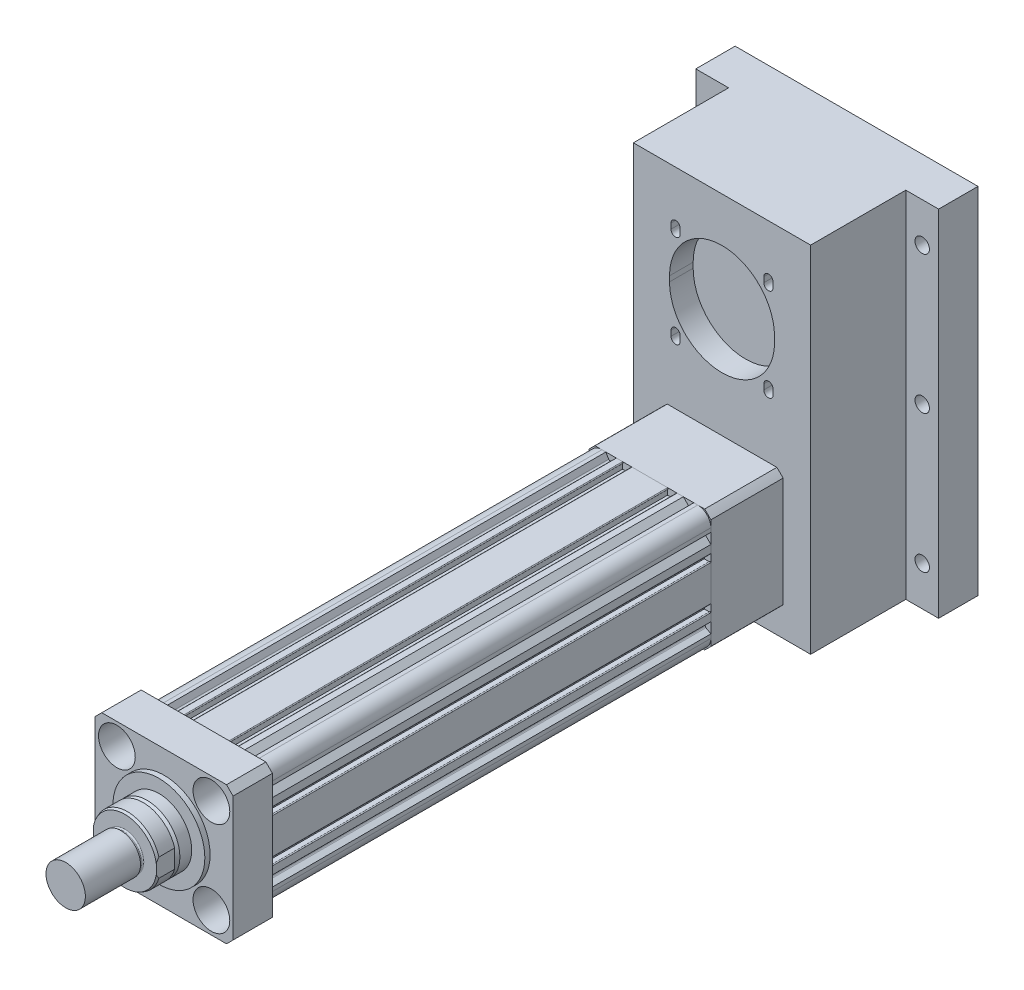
from build123d import *
from OCP.BRepFilletAPI import BRepFilletAPI_MakeChamfer

# Parameters (mm, degrees)
SKETCH_1_R          = 40
SKETCH_1_R_2        = 4.35
EXTRUDE_1_DEPTH     = 340
EXTRUDE_1_2_DEPTH   = 30
SKETCH_3_R          = 35
EXTRUDE_2_DEPTH     = 4
SKETCH_3_3_R        = 6.5
CUT_EXTRUDE_1_DEPTH = 30
SKETCH_3_4_R        = 6.5
CUT_EXTRUDE_2_DEPTH = 17
SKETCH_4_R          = 25
EXTRUDE_3_DEPTH     = 12
CHAMFER_1_SIZE      = 3
CHAMFER_1_SIZE2     = 1.732050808
EXTRUDE_4_DEPTH     = 14
CHAMFER_2_SIZE      = 2
CHAMFER_2_SIZE2     = 0.727940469
SKETCH_6_R          = 13.5
EXTRUDE_5_DEPTH     = 3
SKETCH_7_R          = 15
EXTRUDE_6_DEPTH     = 42
FILLET_1_R          = 1
EXTRUDE_7_DEPTH     = 55
SKETCH_12_W         = 135
SKETCH_12_H         = 270
EXTRUDE_9_DEPTH     = 72.5
CUT_EXTRUDE_5_DEPTH = 18
CUT_EXTRUDE_6_DEPTH = 18
CUT_EXTRUDE_START   = -11.5
CUT_EXTRUDE_7_DEPTH = 6.5
SKETCH_16_W         = 185
SKETCH_16_H         = 270
SKETCH_16_R         = 5.5
EXTRUDE_10_DEPTH    = 30
SKETCH_17_W         = 105
SKETCH_17_H         = 105
EXTRUDE_11_DEPTH    = 30
SKETCH_18_R         = 14
CUT_EXTRUDE_8_DEPTH = 28
SKETCH_19_R         = 6.5
CUT_EXTRUDE_9_DEPTH = 30
CHAMFER_3_SIZE      = 5


with BuildPart() as part:
    # Sketch 1 → Extrude 1 (new body)
    with BuildSketch(Plane.XY):
        with BuildLine():
            Line((46.5, -36.5), (46.5, -33.5))
            Line((46.5, -33.5), (42.782554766, -31.353731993))
            ThreePointArc((42.782554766, -31.353731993), (42.192820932, -30.47113294), (42.534026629, -29.465973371))
            Line((42.534026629, -29.465973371), (46.5, -25.5))
            Line((46.5, -25.5), (46.5, -19.6))
            ThreePointArc((46.5, -19.6), (46.353553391, -19.246446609), (46, -19.1))
            ThreePointArc((46, -19.1), (45.646446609, -19.246446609), (45.5, -19.6))
            Line((45.5, -19.6), (41.5, -19.6))
            Line((41.5, -19.6), (41.5, -13.5))
            Line((41.5, -13.5), (45.5, -13.5))
            ThreePointArc((45.5, -13.5), (45.646446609, -13.853553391), (46, -14))
            ThreePointArc((46, -14), (46.353553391, -13.853553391), (46.5, -13.5))
            Line((46.5, -13.5), (46.5, 13.5))
            ThreePointArc((46.5, 13.5), (46.353553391, 13.853553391), (46, 14))
            ThreePointArc((46, 14), (45.646446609, 13.853553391), (45.5, 13.5))
            Line((45.5, 13.5), (41.5, 13.5))
            Line((41.5, 13.5), (41.5, 19.6))
            Line((41.5, 19.6), (45.5, 19.6))
            ThreePointArc((45.5, 19.6), (45.646446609, 19.246446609), (46, 19.1))
            ThreePointArc((46, 19.1), (46.353553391, 19.246446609), (46.5, 19.6))
            Line((46.5, 19.6), (46.5, 25.5))
            Line((46.5, 25.5), (42.534026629, 29.465973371))
            ThreePointArc((42.534026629, 29.465973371), (42.192820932, 30.47113294), (42.782554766, 31.353731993))
            Line((42.782554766, 31.353731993), (46.5, 33.5))
            Line((46.5, 33.5), (46.5, 36.5))
            ThreePointArc((46.5, 36.5), (43.571067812, 43.571067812), (36.5, 46.5))
            Line((36.5, 46.5), (33.5, 46.5))
            Line((33.5, 46.5), (31.353731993, 42.782554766))
            ThreePointArc((31.353731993, 42.782554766), (30.47113294, 42.192820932), (29.465973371, 42.534026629))
            Line((29.465973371, 42.534026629), (25.5, 46.5))
            Line((25.5, 46.5), (20.8, 46.5))
            ThreePointArc((20.8, 46.5), (20.446446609, 46.353553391), (20.3, 46))
            ThreePointArc((20.3, 46), (20.446446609, 45.646446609), (20.8, 45.5))
            Line((20.8, 45.5), (20.8, 41.5))
            Line((20.8, 41.5), (13.5, 41.5))
            Line((13.5, 41.5), (13.5, 45.5))
            ThreePointArc((13.5, 45.5), (13.853553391, 45.646446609), (14, 46))
            ThreePointArc((14, 46), (13.853553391, 46.353553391), (13.5, 46.5))
            Line((13.5, 46.5), (-13.5, 46.5))
            ThreePointArc((-13.5, 46.5), (-13.853553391, 46.353553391), (-14, 46))
            ThreePointArc((-14, 46), (-13.853553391, 45.646446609), (-13.5, 45.5))
            Line((-13.5, 45.5), (-13.5, 41.5))
            Line((-13.5, 41.5), (-20.8, 41.5))
            Line((-20.8, 41.5), (-20.8, 45.5))
            ThreePointArc((-20.8, 45.5), (-20.446446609, 45.646446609), (-20.3, 46))
            ThreePointArc((-20.3, 46), (-20.446446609, 46.353553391), (-20.8, 46.5))
            Line((-20.8, 46.5), (-25.5, 46.5))
            Line((-25.5, 46.5), (-29.465973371, 42.534026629))
            ThreePointArc((-29.465973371, 42.534026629), (-30.47113294, 42.192820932), (-31.353731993, 42.782554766))
            Line((-31.353731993, 42.782554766), (-33.5, 46.5))
            Line((-33.5, 46.5), (-36.5, 46.5))
            ThreePointArc((-36.5, 46.5), (-43.571067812, 43.571067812), (-46.5, 36.5))
            Line((-46.5, 36.5), (-46.5, 33.5))
            Line((-46.5, 33.5), (-42.782554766, 31.353731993))
            ThreePointArc((-42.782554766, 31.353731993), (-42.192820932, 30.47113294), (-42.534026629, 29.465973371))
            Line((-42.534026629, 29.465973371), (-46.5, 25.5))
            Line((-46.5, 25.5), (-46.5, 20))
            ThreePointArc((-46.5, 20), (-46.353553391, 19.646446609), (-46, 19.5))
            ThreePointArc((-46, 19.5), (-45.646446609, 19.646446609), (-45.5, 20))
            Line((-45.5, 20), (-41.5, 20))
            Line((-41.5, 20), (-41.5, 13.9))
            Line((-41.5, 13.9), (-45.5, 13.9))
            ThreePointArc((-45.5, 13.9), (-45.646446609, 14.253553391), (-46, 14.4))
            ThreePointArc((-46, 14.4), (-46.353553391, 14.253553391), (-46.5, 13.9))
            Line((-46.5, 13.9), (-46.5, -13.9))
            ThreePointArc((-46.5, -13.9), (-46.353553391, -14.253553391), (-46, -14.4))
            ThreePointArc((-46, -14.4), (-45.646446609, -14.253553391), (-45.5, -13.9))
            Line((-45.5, -13.9), (-41.5, -13.9))
            Line((-41.5, -13.9), (-41.5, -20))
            Line((-41.5, -20), (-45.5, -20))
            ThreePointArc((-45.5, -20), (-45.646446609, -19.646446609), (-46, -19.5))
            ThreePointArc((-46, -19.5), (-46.353553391, -19.646446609), (-46.5, -20))
            Line((-46.5, -20), (-46.5, -25.5))
            Line((-46.5, -25.5), (-42.534026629, -29.465973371))
            ThreePointArc((-42.534026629, -29.465973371), (-42.192820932, -30.47113294), (-42.782554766, -31.353731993))
            Line((-42.782554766, -31.353731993), (-46.5, -33.5))
            Line((-46.5, -33.5), (-46.5, -36.5))
            ThreePointArc((-46.5, -36.5), (-43.571067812, -43.571067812), (-36.5, -46.5))
            Line((-36.5, -46.5), (-33.5, -46.5))
            Line((-33.5, -46.5), (-31.353731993, -42.782554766))
            ThreePointArc((-31.353731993, -42.782554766), (-30.47113294, -42.192820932), (-29.465973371, -42.534026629))
            Line((-29.465973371, -42.534026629), (-25.5, -46.5))
            Line((-25.5, -46.5), (25.5, -46.5))
            Line((25.5, -46.5), (29.465973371, -42.534026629))
            ThreePointArc((29.465973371, -42.534026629), (30.47113294, -42.192820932), (31.353731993, -42.782554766))
            Line((31.353731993, -42.782554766), (33.5, -46.5))
            Line((33.5, -46.5), (36.5, -46.5))
            ThreePointArc((36.5, -46.5), (43.571067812, -43.571067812), (46.5, -36.5))
        make_face()
        Circle(SKETCH_1_R, mode=Mode.SUBTRACT)
        with Locations((36, -36)):
            Circle(SKETCH_1_R_2, mode=Mode.SUBTRACT)
        with Locations((-36, -36)):
            Circle(SKETCH_1_R_2, mode=Mode.SUBTRACT)
        with Locations((36, 36)):
            Circle(SKETCH_1_R_2, mode=Mode.SUBTRACT)
        with Locations((-36, 36)):
            Circle(SKETCH_1_R_2, mode=Mode.SUBTRACT)
        with BuildLine():
            Line((25.75, -42.5), (11.324751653, -42.5))
            ThreePointArc((11.324751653, -42.5), (10.829080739, -42.065653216), (11.194582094, -41.517241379))
            ThreePointArc((11.194582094, -41.517241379), (18.919894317, -38.613956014), (25.948275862, -34.288292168))
            ThreePointArc((25.948275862, -34.288292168), (26.472640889, -34.239297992), (26.75, -34.68699324))
            Line((26.75, -34.68699324), (26.75, -41.5))
            Line((26.75, -41.5), (25.75, -42.5))
        make_face(mode=Mode.SUBTRACT)
        with BuildLine():
            Line((-25.75, -42.5), (-11.324751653, -42.5))
            ThreePointArc((-11.324751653, -42.5), (-10.829080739, -42.065653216), (-11.194582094, -41.517241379))
            ThreePointArc((-11.194582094, -41.517241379), (-18.919894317, -38.613956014), (-25.948275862, -34.288292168))
            ThreePointArc((-25.948275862, -34.288292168), (-26.472640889, -34.239297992), (-26.75, -34.68699324))
            Line((-26.75, -34.68699324), (-26.75, -41.5))
            Line((-26.75, -41.5), (-25.75, -42.5))
        make_face(mode=Mode.SUBTRACT)
        with BuildLine():
            Line((26.312283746, 40), (20.798294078, 40))
            ThreePointArc((20.798294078, 40), (20.548294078, 39.933012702), (20.365281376, 39.75))
            Line((20.365281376, 39.75), (19.794336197, 38.761093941))
            ThreePointArc((19.794336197, 38.761093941), (19.747068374, 38.372059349), (19.994850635, 38.068437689))
            ThreePointArc((19.994850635, 38.068437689), (22.57372353, 36.598183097), (25.045011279, 34.953503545))
            ThreePointArc((25.045011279, 34.953503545), (25.441798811, 34.871210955), (25.769245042, 35.109939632))
            Line((25.769245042, 35.109939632), (27.64187192, 38.353424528))
            ThreePointArc((27.64187192, 38.353424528), (27.704581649, 38.668687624), (27.562412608, 38.956977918))
            Line((27.562412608, 38.956977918), (26.665837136, 39.853553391))
            ThreePointArc((26.665837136, 39.853553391), (26.503625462, 39.961939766), (26.312283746, 40))
        make_face(mode=Mode.SUBTRACT)
        with BuildLine():
            Line((38.956977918, 27.562412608), (39.853553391, 26.665837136))
            ThreePointArc((39.853553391, 26.665837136), (39.961939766, 26.503625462), (40, 26.312283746))
            Line((40, 26.312283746), (40, 20.798294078))
            ThreePointArc((40, 20.798294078), (39.933012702, 20.548294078), (39.75, 20.365281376))
            Line((39.75, 20.365281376), (38.761093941, 19.794336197))
            ThreePointArc((38.761093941, 19.794336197), (38.372059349, 19.747068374), (38.068437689, 19.994850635))
            ThreePointArc((38.068437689, 19.994850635), (36.598183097, 22.57372353), (34.953503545, 25.045011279))
            ThreePointArc((34.953503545, 25.045011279), (34.871210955, 25.441798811), (35.109939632, 25.769245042))
            Line((35.109939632, 25.769245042), (38.353424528, 27.64187192))
            ThreePointArc((38.353424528, 27.64187192), (38.668687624, 27.704581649), (38.956977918, 27.562412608))
        make_face(mode=Mode.SUBTRACT)
        with BuildLine():
            Line((38.956977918, -27.562412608), (39.853553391, -26.665837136))
            ThreePointArc((39.853553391, -26.665837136), (39.961939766, -26.503625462), (40, -26.312283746))
            Line((40, -26.312283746), (40, -20.798294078))
            ThreePointArc((40, -20.798294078), (39.933012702, -20.548294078), (39.75, -20.365281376))
            Line((39.75, -20.365281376), (38.761093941, -19.794336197))
            ThreePointArc((38.761093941, -19.794336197), (38.372059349, -19.747068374), (38.068437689, -19.994850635))
            ThreePointArc((38.068437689, -19.994850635), (36.598183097, -22.57372353), (34.953503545, -25.045011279))
            ThreePointArc((34.953503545, -25.045011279), (34.871210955, -25.441798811), (35.109939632, -25.769245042))
            Line((35.109939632, -25.769245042), (38.353424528, -27.64187192))
            ThreePointArc((38.353424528, -27.64187192), (38.668687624, -27.704581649), (38.956977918, -27.562412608))
        make_face(mode=Mode.SUBTRACT)
        with BuildLine():
            Line((-39.75, -20.365281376), (-38.761093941, -19.794336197))
            ThreePointArc((-38.761093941, -19.794336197), (-38.372059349, -19.747068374), (-38.068437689, -19.994850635))
            ThreePointArc((-38.068437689, -19.994850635), (-36.598183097, -22.57372353), (-34.953503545, -25.045011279))
            ThreePointArc((-34.953503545, -25.045011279), (-34.871210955, -25.441798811), (-35.109939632, -25.769245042))
            Line((-35.109939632, -25.769245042), (-38.353424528, -27.64187192))
            ThreePointArc((-38.353424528, -27.64187192), (-38.668687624, -27.704581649), (-38.956977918, -27.562412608))
            Line((-38.956977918, -27.562412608), (-39.853553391, -26.665837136))
            ThreePointArc((-39.853553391, -26.665837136), (-39.961939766, -26.503625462), (-40, -26.312283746))
            Line((-40, -26.312283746), (-40, -20.798294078))
            ThreePointArc((-40, -20.798294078), (-39.933012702, -20.548294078), (-39.75, -20.365281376))
        make_face(mode=Mode.SUBTRACT)
        with BuildLine():
            Line((-20.365281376, 39.75), (-19.794336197, 38.761093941))
            ThreePointArc((-19.794336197, 38.761093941), (-19.747068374, 38.372059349), (-19.994850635, 38.068437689))
            ThreePointArc((-19.994850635, 38.068437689), (-22.57372353, 36.598183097), (-25.045011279, 34.953503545))
            ThreePointArc((-25.045011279, 34.953503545), (-25.441798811, 34.871210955), (-25.769245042, 35.109939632))
            Line((-25.769245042, 35.109939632), (-27.64187192, 38.353424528))
            ThreePointArc((-27.64187192, 38.353424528), (-27.704581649, 38.668687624), (-27.562412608, 38.956977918))
            Line((-27.562412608, 38.956977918), (-26.665837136, 39.853553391))
            ThreePointArc((-26.665837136, 39.853553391), (-26.503625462, 39.961939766), (-26.312283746, 40))
            Line((-26.312283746, 40), (-20.798294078, 40))
            ThreePointArc((-20.798294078, 40), (-20.548294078, 39.933012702), (-20.365281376, 39.75))
        make_face(mode=Mode.SUBTRACT)
        with BuildLine():
            Line((-38.956977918, 27.562412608), (-39.853553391, 26.665837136))
            ThreePointArc((-39.853553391, 26.665837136), (-39.961939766, 26.503625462), (-40, 26.312283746))
            Line((-40, 26.312283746), (-40, 20.798294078))
            ThreePointArc((-40, 20.798294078), (-39.933012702, 20.548294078), (-39.75, 20.365281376))
            Line((-39.75, 20.365281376), (-38.761093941, 19.794336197))
            ThreePointArc((-38.761093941, 19.794336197), (-38.372059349, 19.747068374), (-38.068437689, 19.994850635))
            ThreePointArc((-38.068437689, 19.994850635), (-36.598183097, 22.57372353), (-34.953503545, 25.045011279))
            ThreePointArc((-34.953503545, 25.045011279), (-34.871210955, 25.441798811), (-35.109939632, 25.769245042))
            Line((-35.109939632, 25.769245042), (-38.353424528, 27.64187192))
            ThreePointArc((-38.353424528, 27.64187192), (-38.668687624, 27.704581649), (-38.956977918, 27.562412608))
        make_face(mode=Mode.SUBTRACT)
    extrude(amount=EXTRUDE_1_DEPTH)

    # Sketch 2 → Extrude 1 2 (add)
    with BuildSketch(Plane.XY.offset(340)):
        Polygon((-52.5, 50.5), (-50.5, 52.5), (50.5, 52.5), (52.5, 50.5), (52.5, -50.5), (50.5, -52.5), (-50.5, -52.5), (-52.5, -50.5), align=None)
    extrude(amount=EXTRUDE_1_2_DEPTH)

    # Sketch 3 → Extrude 2 (add)
    with BuildSketch(Plane.XY.offset(370)):
        Circle(SKETCH_3_R)
    extrude(amount=EXTRUDE_2_DEPTH)

    # Sketch 3_3 → Cut-Extrude 1 (cut)
    with BuildSketch(Plane.XY.offset(370)):
        with Locations((-36, 36)):
            Circle(SKETCH_3_3_R)
        with Locations((36, 36)):
            Circle(SKETCH_3_3_R)
        with Locations((60, 32.5)):
            Circle(SKETCH_3_3_R)
        with Locations((36, -36)):
            Circle(SKETCH_3_3_R)
        with Locations((-36, -36)):
            Circle(SKETCH_3_3_R)
        with Locations((-60, -32.5)):
            Circle(SKETCH_3_3_R)
        with Locations((-60, 32.5)):
            Circle(SKETCH_3_3_R)
    extrude(amount=-CUT_EXTRUDE_1_DEPTH, mode=Mode.SUBTRACT)

    # Sketch 3_4 → Cut-Extrude 2 (cut)
    # profile 1 of 4: a face of its own
    with BuildSketch(Plane.XY.offset(370)):
        with BuildLine():
            Line((50, 52.5), (22, 52.5))
            Line((22, 52.5), (22, 36))
            ThreePointArc((22, 36), (36, 22), (50, 36))
            Line((50, 36), (50, 52.5))
        make_face()
        with Locations((36, 36)):
            Circle(SKETCH_3_4_R, mode=Mode.SUBTRACT)
    # profile 2 of 4: a face of its own
    with BuildSketch(Plane.XY.offset(370)):
        with BuildLine():
            Line((50, -52.5), (50, -36))
            ThreePointArc((50, -36), (36, -22), (22, -36))
            Line((22, -36), (22, -52.5))
            Line((22, -52.5), (50, -52.5))
        make_face()
        with Locations((36, -36)):
            Circle(SKETCH_3_4_R, mode=Mode.SUBTRACT)
    # profile 3 of 4: a face of its own
    with BuildSketch(Plane.XY.offset(370)):
        with BuildLine():
            Line((-50, -52.5), (-22, -52.5))
            Line((-22, -52.5), (-22, -36))
            ThreePointArc((-22, -36), (-36, -22), (-50, -36))
            Line((-50, -36), (-50, -52.5))
        make_face()
        with Locations((-36, -36)):
            Circle(SKETCH_3_4_R, mode=Mode.SUBTRACT)
    # profile 4 of 4: a face of its own
    with BuildSketch(Plane.XY.offset(370)):
        with BuildLine():
            Line((-50, 36), (-50, 52.5))
            Line((-50, 52.5), (-22, 52.5))
            Line((-22, 52.5), (-22, 36))
            ThreePointArc((-22, 36), (-36, 22), (-50, 36))
        make_face()
    extrude(amount=-CUT_EXTRUDE_2_DEPTH, mode=Mode.SUBTRACT)

    # Sketch 4 → Extrude 3 (add)
    with BuildSketch(Plane.XY.offset(374)):
        Circle(SKETCH_4_R)
    extrude(amount=EXTRUDE_3_DEPTH)

    # Chamfer 1
    chamfer_1_edges = [part.edges().sort_by_distance(p)[0] for p in [
        (-25, 0, 386),
    ]]
    chamfer_1_side = [part.faces().sort_by_distance(p)[0] for p in [
        (-25, 0, 380),
    ]]
    chamfer(chamfer_1_edges, length=CHAMFER_1_SIZE, length2=CHAMFER_1_SIZE2, reference=chamfer_1_side[0])

    # Sketch 5 → Extrude 4 (add)
    with BuildSketch(Plane.XY.offset(386)):
        with BuildLine():
            Line((-24, 7), (-24, -7))
            ThreePointArc((-24, -7), (0, -25), (24, -7))
            Line((24, -7), (24, 7))
            ThreePointArc((24, 7), (0, 25), (-24, 7))
        make_face()
    extrude(amount=EXTRUDE_4_DEPTH)

    # Chamfer 2: one chamfer whose edges measure the first distance from different faces: ONE call of the kernel's chamfer builder (chamfer() names one face for all edges)
    chamfer_2_edges_1 = [part.edges().sort_by_distance(p)[0] for p in [
        (0, 25, 400),
    ]]
    chamfer_2_side_1 = [part.faces().sort_by_distance(p)[0] for p in [
        (0, 25, 393),
    ]]
    chamfer_2_edges_2 = [part.edges().sort_by_distance(p)[0] for p in [
        (0, -25, 400),
    ]]
    chamfer_2_side_2 = [part.faces().sort_by_distance(p)[0] for p in [
        (0, -25, 393),
    ]]
    chamfer_2 = BRepFilletAPI_MakeChamfer(part.part.solid().wrapped)
    for e in chamfer_2_edges_1:
        chamfer_2.Add(CHAMFER_2_SIZE, CHAMFER_2_SIZE2, e.wrapped, chamfer_2_side_1[0].wrapped)  # the first distance lies on this face
    for e in chamfer_2_edges_2:
        chamfer_2.Add(CHAMFER_2_SIZE, CHAMFER_2_SIZE2, e.wrapped, chamfer_2_side_2[0].wrapped)  # the first distance lies on this face
    add(Compound.cast(chamfer_2.Shape()), mode=Mode.REPLACE)

    # Sketch 6 → Extrude 5 (add)
    with BuildSketch(Plane.XY.offset(400)):
        Circle(SKETCH_6_R)
    extrude(amount=EXTRUDE_5_DEPTH)

    # Sketch 7 → Extrude 6 (add)
    with BuildSketch(Plane.XY.offset(403)):
        with Locations(Location((0, 0, 0), (0, 0, 180))):
            Circle(SKETCH_7_R)
    extrude(amount=EXTRUDE_6_DEPTH)

    # Fillet 1
    fillet_1_edges = [part.edges().sort_by_distance(p)[0] for p in [
        (-13.5, 0, 400),
    ]]
    fillet(fillet_1_edges, radius=FILLET_1_R)

    # Sketch 17 → Extrude 11 (add)
    with BuildSketch(Plane.XY.offset(370)):
        Rectangle(SKETCH_17_W, SKETCH_17_H)
    extrude(amount=-EXTRUDE_11_DEPTH)

    # Sketch 18 → Cut-Extrude 8 (cut)
    with BuildSketch(Plane.XY.offset(370)):
        with Locations((-36, 36)):
            Circle(SKETCH_18_R)
        with Locations((36, 36)):
            Circle(SKETCH_18_R)
        with Locations((36, -36)):
            Circle(SKETCH_18_R)
        with Locations((-36, -36)):
            Circle(SKETCH_18_R)
    extrude(amount=-CUT_EXTRUDE_8_DEPTH, mode=Mode.SUBTRACT)

    # Sketch 19 → Cut-Extrude 9 (cut)
    with BuildSketch(Plane.XY.offset(342)):
        with Locations((-36, 36)):
            Circle(SKETCH_19_R)
        with Locations((36, 36)):
            Circle(SKETCH_19_R)
        with Locations((36, -36)):
            Circle(SKETCH_19_R)
        with Locations((-36, -36)):
            Circle(SKETCH_19_R)
    extrude(amount=-CUT_EXTRUDE_9_DEPTH, mode=Mode.SUBTRACT)

    # Chamfer 3
    chamfer_3_edges = [part.edges().sort_by_distance(p)[0] for p in [
        (52.5, 52.5, 355),
        (-52.5, -52.5, 355),
        (52.5, -52.5, 355),
        (-52.5, 52.5, 355),
    ]]
    chamfer(chamfer_3_edges, length=CHAMFER_3_SIZE)


with BuildPart() as body_2:
    # Sketch 8 → Extrude 7 (new body)
    with BuildSketch(Plane(origin=(0, 0, 0), x_dir=(-1, 0, 0), z_dir=(0, 0, -1))):
        with BuildLine():
            Line((-41.761226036, 46.5), (41.761226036, 46.5))
            ThreePointArc((41.761226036, 46.5), (44.194173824, 44.194173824), (46.5, 41.761226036))
            Line((46.5, 41.761226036), (46.5, -41.761226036))
            ThreePointArc((46.5, -41.761226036), (44.194173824, -44.194173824), (41.761226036, -46.5))
            Line((41.761226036, -46.5), (-41.761226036, -46.5))
            ThreePointArc((-41.761226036, -46.5), (-44.194173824, -44.194173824), (-46.5, -41.761226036))
            Line((-46.5, -41.761226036), (-46.5, 41.761226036))
            ThreePointArc((-46.5, 41.761226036), (-44.194173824, 44.194173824), (-41.761226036, 46.5))
        make_face()
    extrude(amount=EXTRUDE_7_DEPTH)

    # Sketch 12 → Extrude 9 (add)
    with BuildSketch(Plane(origin=(0, 0, -55), x_dir=(-1, 0, 0), z_dir=(0, 0, -1))):
        with Locations((0, 71)):
            Rectangle(SKETCH_12_W, SKETCH_12_H)
    extrude(amount=EXTRUDE_9_DEPTH)

    # Sketch 13 → Cut-Extrude 5 (cut)
    with BuildSketch(Plane.XY.offset(-55)):
        with BuildLine():
            Line((-40, 132), (-40, 128))
            ThreePointArc((-40, 128), (0, 88), (40, 128))
            Line((40, 128), (40, 132))
            ThreePointArc((40, 132), (0, 172), (-40, 132))
        make_face()
    extrude(amount=-CUT_EXTRUDE_5_DEPTH, mode=Mode.SUBTRACT)

    # Sketch 13_3 → Cut-Extrude 6 (cut)
    with BuildSketch(Plane.XY.offset(-55)):
        with BuildLine():
            ThreePointArc((31.855339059, 167.355339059), (35.355339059, 170.855339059), (38.855339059, 167.355339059))
            Line((38.855339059, 167.355339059), (38.855339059, 163.355339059))
            ThreePointArc((38.855339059, 163.355339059), (35.355339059, 159.855339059), (31.855339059, 163.355339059))
            Line((31.855339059, 163.355339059), (31.855339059, 167.355339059))
        make_face()
        with BuildLine():
            ThreePointArc((-31.855339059, 92.644660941), (-35.355339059, 89.144660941), (-38.855339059, 92.644660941))
            Line((-38.855339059, 92.644660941), (-38.855339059, 96.644660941))
            ThreePointArc((-38.855339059, 96.644660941), (-35.355339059, 100.144660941), (-31.855339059, 96.644660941))
            Line((-31.855339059, 96.644660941), (-31.855339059, 92.644660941))
        make_face()
        with BuildLine():
            ThreePointArc((-31.855339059, 167.355339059), (-35.355339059, 170.855339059), (-38.855339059, 167.355339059))
            Line((-38.855339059, 167.355339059), (-38.855339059, 163.355339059))
            ThreePointArc((-38.855339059, 163.355339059), (-35.355339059, 159.855339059), (-31.855339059, 163.355339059))
            Line((-31.855339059, 163.355339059), (-31.855339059, 167.355339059))
        make_face()
        with BuildLine():
            ThreePointArc((38.855339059, 96.644660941), (35.355339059, 100.144660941), (31.855339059, 96.644660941))
            Line((31.855339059, 96.644660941), (31.855339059, 92.644660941))
            ThreePointArc((31.855339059, 92.644660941), (35.355339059, 89.144660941), (38.855339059, 92.644660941))
            Line((38.855339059, 92.644660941), (38.855339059, 96.644660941))
        make_face()
    extrude(amount=-CUT_EXTRUDE_6_DEPTH, mode=Mode.SUBTRACT)

    # Sketch 13_4 → Cut-Extrude 7 (cut)
    with BuildSketch(Plane.XY.offset(-55).offset(CUT_EXTRUDE_START)):
        with BuildLine():
            Line((-40.555339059, 163.305339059), (-40.555339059, 167.405339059))
            ThreePointArc((-40.555339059, 167.405339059), (-35.355339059, 172.605339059), (-30.155339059, 167.405339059))
            Line((-30.155339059, 167.405339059), (-30.155339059, 163.305339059))
            ThreePointArc((-30.155339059, 163.305339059), (-35.355339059, 158.105339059), (-40.555339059, 163.305339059))
        make_face()
        with BuildLine():
            Line((40.555339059, 163.305339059), (40.555339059, 167.405339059))
            ThreePointArc((40.555339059, 167.405339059), (35.355339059, 172.605339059), (30.155339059, 167.405339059))
            Line((30.155339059, 167.405339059), (30.155339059, 163.305339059))
            ThreePointArc((30.155339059, 163.305339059), (35.355339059, 158.105339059), (40.555339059, 163.305339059))
        make_face()
        with BuildLine():
            Line((40.555339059, 96.694660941), (40.555339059, 92.594660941))
            ThreePointArc((40.555339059, 92.594660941), (35.355339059, 87.394660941), (30.155339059, 92.594660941))
            Line((30.155339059, 92.594660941), (30.155339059, 96.694660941))
            ThreePointArc((30.155339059, 96.694660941), (35.355339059, 101.894660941), (40.555339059, 96.694660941))
        make_face()
        with BuildLine():
            Line((-40.555339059, 96.694660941), (-40.555339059, 92.594660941))
            ThreePointArc((-40.555339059, 92.594660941), (-35.355339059, 87.394660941), (-30.155339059, 92.594660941))
            Line((-30.155339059, 92.594660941), (-30.155339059, 96.694660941))
            ThreePointArc((-30.155339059, 96.694660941), (-35.355339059, 101.894660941), (-40.555339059, 96.694660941))
        make_face()
    extrude(amount=-CUT_EXTRUDE_7_DEPTH, mode=Mode.SUBTRACT)

    # Sketch 16 → Extrude 10 (add)
    with BuildSketch(Plane(origin=(0, 0, -127.5), x_dir=(-1, 0, 0), z_dir=(0, 0, -1))):
        with Locations((0, 71)):
            Rectangle(SKETCH_16_W, SKETCH_16_H)
        with Locations((-80, -34)):
            Circle(SKETCH_16_R, mode=Mode.SUBTRACT)
        with Locations((-80, 71)):
            Circle(SKETCH_16_R, mode=Mode.SUBTRACT)
        with Locations((-80, 176)):
            Circle(SKETCH_16_R, mode=Mode.SUBTRACT)
        with Locations(Location((80, -34, 0), (0, 0, 180))):
            Circle(SKETCH_16_R, mode=Mode.SUBTRACT)
        with Locations(Location((80, 71, 0), (0, 0, 180))):
            Circle(SKETCH_16_R, mode=Mode.SUBTRACT)
        with Locations(Location((80, 176, 0), (0, 0, 180))):
            Circle(SKETCH_16_R, mode=Mode.SUBTRACT)
    extrude(amount=EXTRUDE_10_DEPTH)


solid = Compound([part.part, body_2.part])
